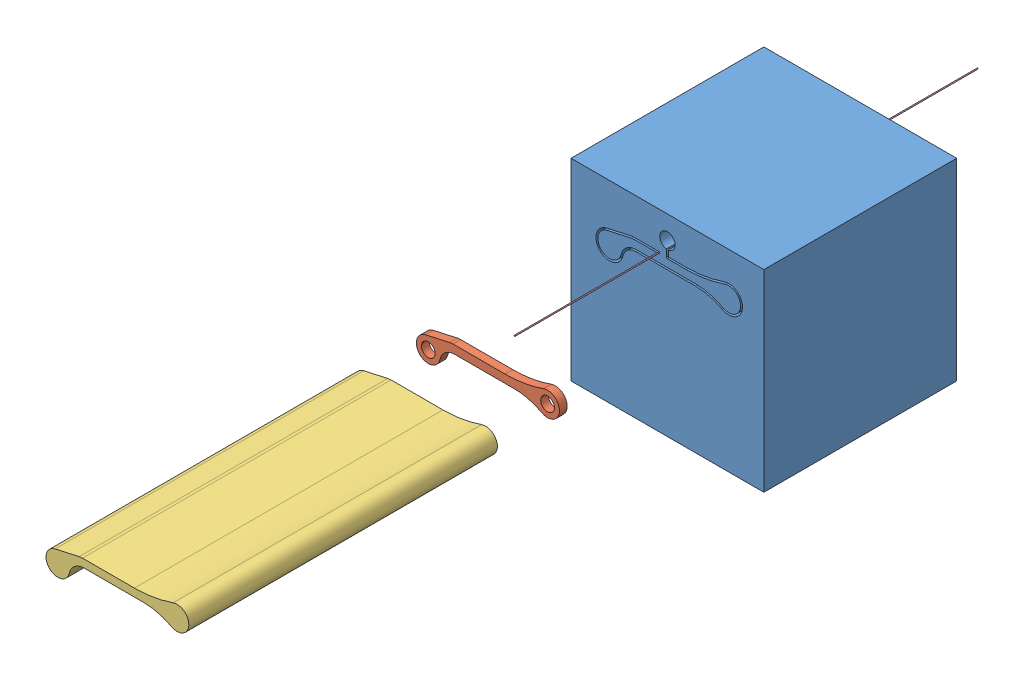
SolidWorks assembly EeFil_biellette.SLDASM, configuration Défaut (file format 5000). Lengths in mm.
Overall size (50 50 225.68).
4 component instances, 4 part files, 0 mates.
Components (placement in the parent):
- brut_poin_S_gon-1: brut_poin_S_gon.sldprt [Défaut] at origin size (50 50 50)
- biellette-1: biellette.sldprt [Défaut] at (10 35.5 97) x (1 0 0) z (0 0 -1) size (37.12 9.5 2)
- poin_S_gon-1: poin_S_gon.sldprt [Défaut] at (-5.1415 36.1147 193.0566) x (-0.999634 -0.02704 0) z (0 0 -1) size (37.12 8.58 80)
- fil-1: fil.sldprt [Défaut] at (15.2729 39.84 87.3723) x (0.220323 0.975427 0) z (0 0 1) size (0.25 0.25 120)
